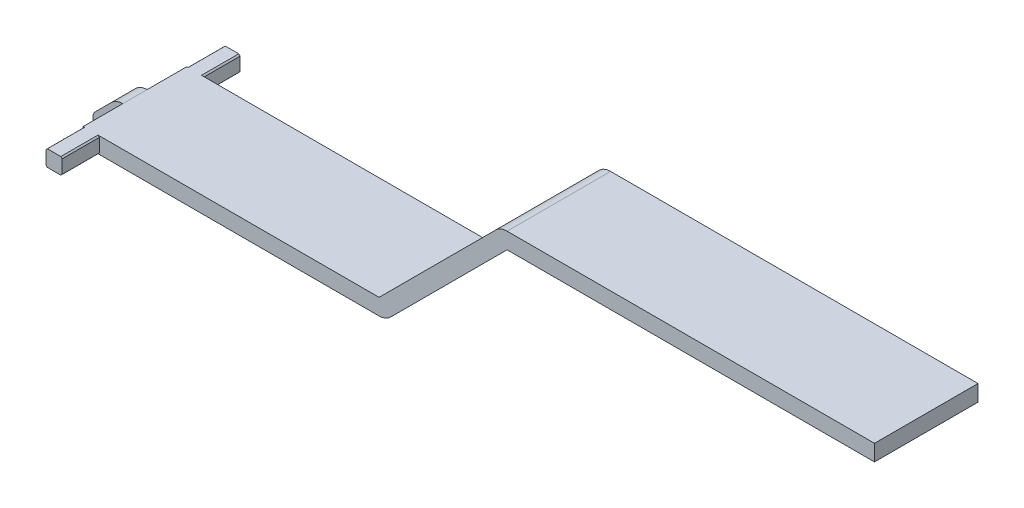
from build123d import *

# Parameters (mm, degrees)
BOSS_EXTRU_1_DEPTH      = 3.2
ESQUISSE2_W             = 1
ESQUISSE2_H             = 1
BOSS_EXTRU_2_DEPTH      = 5.5
ESQUISSE3_OUTSIDE_W     = 61.095
ESQUISSE3_OUTSIDE_H     = 20.672
ESQUISSE3_OUTSIDE_R     = 0.65
ENL_V_MAT_EXTRU_1_DEPTH = 2.3
ESQUISSE4_OUTSIDE_W     = 61.095
ESQUISSE4_OUTSIDE_H     = 20.672
ESQUISSE4_OUTSIDE_R     = 0.65
ENL_V_MAT_EXTRU_2_DEPTH = 2.3
BOSS_EXTRU_3_DEPTH      = 0.75
CONG_1_R                = 1


with BuildPart() as part:
    # Esquisse1 → Boss.-Extru.1 (new, symmetric)
    with BuildSketch(Plane.XY):
        Polygon((0, -0.5), (18.207106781, -0.5), (25.707106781, 7), (48.422618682, 7), (48.422618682, 8), (25.292893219, 8), (17.792893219, 0.5), (0, 0.5), (-0.5, 0.5), (-0.5, -0.5), align=None)
    extrude(amount=BOSS_EXTRU_1_DEPTH, both=True)

    # Esquisse2 → Boss.-Extru.2 (add, symmetric)
    with BuildSketch(Plane.XY):
        Rectangle(ESQUISSE2_W, ESQUISSE2_H)
    extrude(amount=BOSS_EXTRU_2_DEPTH, both=True)

    # Esquisse3 outside → Enl_v. mat.-Extru.1 (cut)
    with BuildSketch(Plane.XY.offset(5.5)):
        with Locations((23.9615, 3.75)):
            Rectangle(ESQUISSE3_OUTSIDE_W, ESQUISSE3_OUTSIDE_H)
        Circle(ESQUISSE3_OUTSIDE_R, mode=Mode.SUBTRACT)
    extrude(amount=-ENL_V_MAT_EXTRU_1_DEPTH, mode=Mode.SUBTRACT)

    # Esquisse4 outside → Enl_v. mat.-Extru.2 (cut)
    with BuildSketch(Plane(origin=(0, 0, -5.5), x_dir=(-1, 0, 0), z_dir=(0, 0, -1))):
        with Locations((-23.9615, 3.75)):
            Rectangle(ESQUISSE4_OUTSIDE_W, ESQUISSE4_OUTSIDE_H)
        Circle(ESQUISSE4_OUTSIDE_R, mode=Mode.SUBTRACT)
    extrude(amount=-ENL_V_MAT_EXTRU_2_DEPTH, mode=Mode.SUBTRACT)

    # Esquisse6 → Boss.-Extru.3 (add, symmetric)
    with BuildSketch(Plane.XY):
        with BuildLine():
            Line((-0.5, -0.5), (-1.503553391, -1.503553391))
            ThreePointArc((-1.503553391, -1.503553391), (-2.210660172, -1.503553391), (-2.210660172, -0.796446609))
            Line((-2.210660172, -0.796446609), (-1.207106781, 0.207106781))
            ThreePointArc((-1.207106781, 0.207106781), (-0.882683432, 0.423879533), (-0.5, 0.5))
            Line((-0.5, 0.5), (-0.5, -0.5))
        make_face()
    extrude(amount=BOSS_EXTRU_3_DEPTH, both=True)

    # Cong_1
    cong_1_edges = [part.edges().sort_by_distance(p)[0] for p in [
        (18.207106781, -0.5, 0),
        (25.292893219, 8, 0),
    ]]
    fillet(cong_1_edges, radius=CONG_1_R)


solid = part.part
